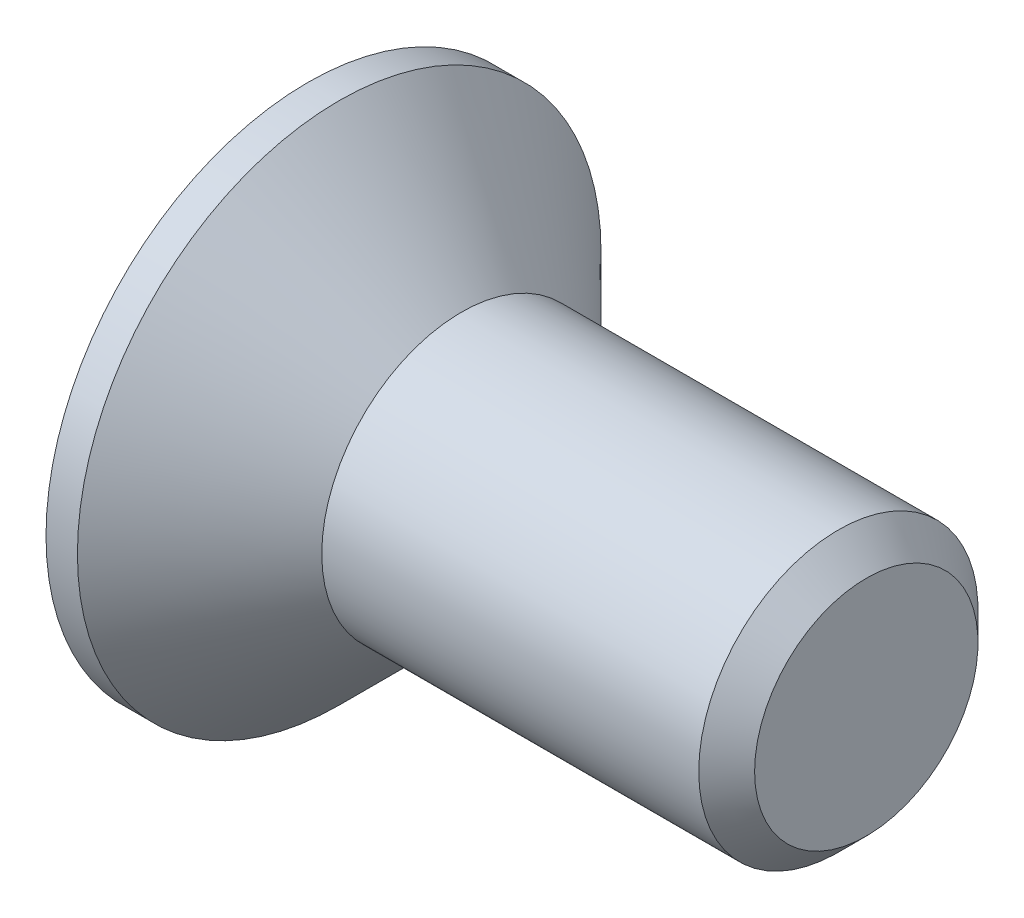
from build123d import *

# Parameters (mm, degrees)
CHAMFER1_SIZE      = 0.4
CUT_EXTRUDE1_DEPTH = 1.9


with BuildPart() as part:
    # Sketch1 → Revolve1 (revolve)
    with BuildSketch(Plane.XY, mode=Mode.PRIVATE) as revolve1_sk:
        Polygon((-2.2, 3.75), (-2.2, 0), (5.8, 0), (5.8, 2), (0, 2), (-1.75, 3.75), align=None)
    revolve(revolve1_sk.sketch.rotate(Axis((-2.2, 0, 0), (1, 0, 0)), 90), axis=Axis((-2.2, 0, 0), (1, 0, 0)))

    # Chamfer1
    chamfer1_edges = [part.edges().sort_by_distance(p)[0] for p in [
        (5.8, 0, -2),
    ]]
    chamfer(chamfer1_edges, length=CHAMFER1_SIZE)

    # Sketch2 → Cut-Extrude1 (cut)
    with BuildSketch(Plane.ZY.offset(2.2)):
        Polygon((-0.55, 2.2), (0.55, 2.2), (0.55, 0.55), (2.2, 0.55), (2.2, -0.55), (0.55, -0.55), (0.55, -2.2), (-0.55, -2.2), (-0.55, -0.55), (-2.2, -0.55), (-2.2, 0.55), (-0.55, 0.55), align=None)
    extrude(amount=-CUT_EXTRUDE1_DEPTH, mode=Mode.SUBTRACT)


solid = part.part
